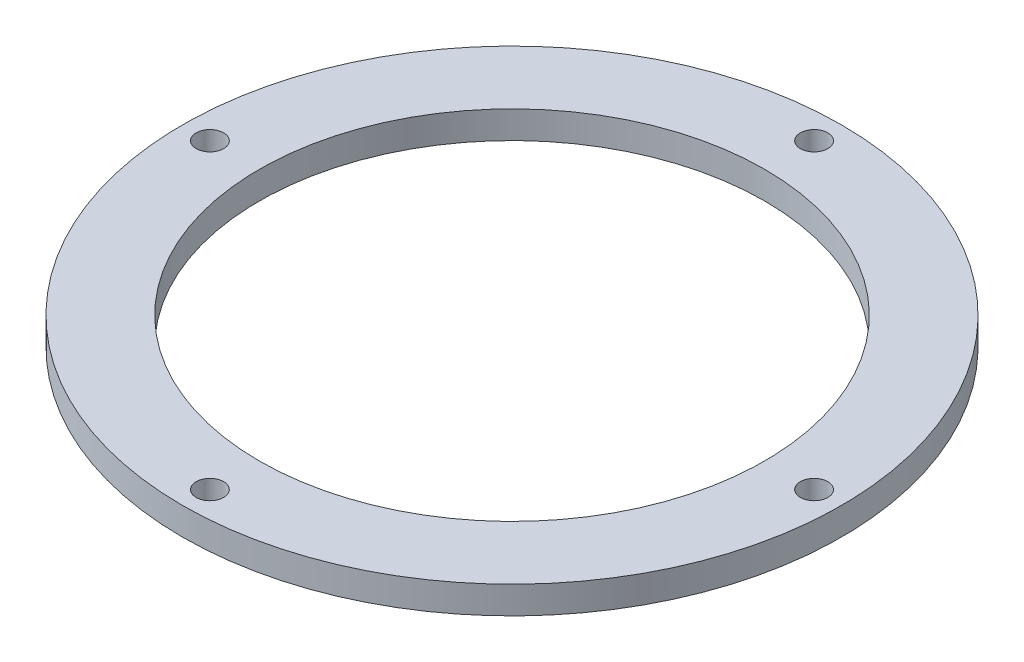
ISO-10303-21;
HEADER;
FILE_DESCRIPTION(('STEP AP214'),'2;1');
FILE_NAME('part.step','',(''),(''),'','','');
FILE_SCHEMA(('AUTOMOTIVE_DESIGN { 1 0 10303 214 1 1 1 1 }'));
ENDSEC;
DATA;
#1=APPLICATION_CONTEXT('core data for automotive mechanical design processes');
#2=APPLICATION_PROTOCOL_DEFINITION('international standard','automotive_design',2000,#1);
#3=PRODUCT_CONTEXT('',#1,'mechanical');
#4=PRODUCT('Part','Part','',(#3));
#5=PRODUCT_RELATED_PRODUCT_CATEGORY('part','',(#4));
#6=PRODUCT_DEFINITION_FORMATION('','',#4);
#7=PRODUCT_DEFINITION_CONTEXT('part definition',#1,'design');
#8=PRODUCT_DEFINITION('design','',#6,#7);
#9=PRODUCT_DEFINITION_SHAPE('','',#8);
#10=(LENGTH_UNIT() NAMED_UNIT(*) SI_UNIT(.MILLI.,.METRE.));
#11=(NAMED_UNIT(*) PLANE_ANGLE_UNIT() SI_UNIT($,.RADIAN.));
#12=(NAMED_UNIT(*) SI_UNIT($,.STERADIAN.) SOLID_ANGLE_UNIT());
#13=UNCERTAINTY_MEASURE_WITH_UNIT(LENGTH_MEASURE(1.E-05),#10,'distance_accuracy_value','');
#14=(GEOMETRIC_REPRESENTATION_CONTEXT(3) GLOBAL_UNCERTAINTY_ASSIGNED_CONTEXT((#13)) GLOBAL_UNIT_ASSIGNED_CONTEXT((#10,
#11,#12)) REPRESENTATION_CONTEXT('',''));
#15=CARTESIAN_POINT('',(0.,0.,0.));
#16=DIRECTION('',(0.,0.,1.));
#17=DIRECTION('',(1.,0.,0.));
#18=AXIS2_PLACEMENT_3D('',#15,#16,#17);
#19=CARTESIAN_POINT('',(0.,5.,0.));
#20=DIRECTION('',(0.,1.,0.));
#21=DIRECTION('',(0.,0.,1.));
#22=AXIS2_PLACEMENT_3D('',#19,#20,#21);
#23=PLANE('',#22);
#24=CARTESIAN_POINT('',(0.,5.,-55.));
#25=DIRECTION('',(0.,1.,0.));
#26=DIRECTION('',(0.,0.,1.));
#27=AXIS2_PLACEMENT_3D('',#24,#25,#26);
#28=CIRCLE('',#27,2.5);
#29=CARTESIAN_POINT('',(0.,5.,-52.5));
#30=VERTEX_POINT('',#29);
#31=EDGE_CURVE('E69',#30,#30,#28,.T.);
#32=ORIENTED_EDGE('',*,*,#31,.F.);
#33=EDGE_LOOP('',(#32));
#34=FACE_BOUND('',#33,.T.);
#35=CARTESIAN_POINT('',(55.0000000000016,5.,-1.55431223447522E-12));
#36=DIRECTION('',(0.,1.,0.));
#37=DIRECTION('',(0.,0.,1.));
#38=AXIS2_PLACEMENT_3D('',#35,#36,#37);
#39=CIRCLE('',#38,2.5);
#40=CARTESIAN_POINT('',(55.0000000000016,5.,2.49999999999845));
#41=VERTEX_POINT('',#40);
#42=EDGE_CURVE('E63',#41,#41,#39,.T.);
#43=ORIENTED_EDGE('',*,*,#42,.F.);
#44=EDGE_LOOP('',(#43));
#45=FACE_BOUND('',#44,.T.);
#46=CARTESIAN_POINT('',(3.11296127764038E-12,5.,55.));
#47=DIRECTION('',(0.,1.,0.));
#48=DIRECTION('',(0.,0.,1.));
#49=AXIS2_PLACEMENT_3D('',#46,#47,#48);
#50=CIRCLE('',#49,2.5);
#51=CARTESIAN_POINT('',(3.11296127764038E-12,5.,57.5));
#52=VERTEX_POINT('',#51);
#53=EDGE_CURVE('E57',#52,#52,#50,.T.);
#54=ORIENTED_EDGE('',*,*,#53,.F.);
#55=EDGE_LOOP('',(#54));
#56=FACE_BOUND('',#55,.T.);
#57=CARTESIAN_POINT('',(-54.9999999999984,5.,1.54737334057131E-12));
#58=DIRECTION('',(0.,1.,0.));
#59=DIRECTION('',(0.,0.,1.));
#60=AXIS2_PLACEMENT_3D('',#57,#58,#59);
#61=CIRCLE('',#60,2.5);
#62=CARTESIAN_POINT('',(-54.9999999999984,5.,2.50000000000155));
#63=VERTEX_POINT('',#62);
#64=EDGE_CURVE('E51',#63,#63,#61,.T.);
#65=ORIENTED_EDGE('',*,*,#64,.F.);
#66=EDGE_LOOP('',(#65));
#67=FACE_BOUND('',#66,.T.);
#68=CARTESIAN_POINT('',(0.,5.,0.));
#69=DIRECTION('',(0.,1.,0.));
#70=DIRECTION('',(0.,0.,1.));
#71=AXIS2_PLACEMENT_3D('',#68,#69,#70);
#72=CIRCLE('',#71,60.);
#73=CARTESIAN_POINT('',(0.,5.,60.));
#74=VERTEX_POINT('',#73);
#75=EDGE_CURVE('E10',#74,#74,#72,.T.);
#76=ORIENTED_EDGE('',*,*,#75,.T.);
#77=EDGE_LOOP('',(#76));
#78=FACE_BOUND('',#77,.T.);
#79=CARTESIAN_POINT('',(0.,5.,0.));
#80=DIRECTION('',(0.,1.,0.));
#81=DIRECTION('',(0.,0.,1.));
#82=AXIS2_PLACEMENT_3D('',#79,#80,#81);
#83=CIRCLE('',#82,46.);
#84=CARTESIAN_POINT('',(0.,5.,46.));
#85=VERTEX_POINT('',#84);
#86=EDGE_CURVE('E43',#85,#85,#83,.T.);
#87=ORIENTED_EDGE('',*,*,#86,.F.);
#88=EDGE_LOOP('',(#87));
#89=FACE_BOUND('',#88,.T.);
#90=ADVANCED_FACE('F32',(#34,#45,#56,#67,#78,#89),#23,.T.);
#91=CARTESIAN_POINT('',(0.,0.,0.));
#92=DIRECTION('',(0.,1.,0.));
#93=DIRECTION('',(0.,0.,1.));
#94=AXIS2_PLACEMENT_3D('',#91,#92,#93);
#95=PLANE('',#94);
#96=CARTESIAN_POINT('',(0.,0.,-55.));
#97=DIRECTION('',(0.,1.,0.));
#98=DIRECTION('',(0.,0.,1.));
#99=AXIS2_PLACEMENT_3D('',#96,#97,#98);
#100=CIRCLE('',#99,2.5);
#101=CARTESIAN_POINT('',(0.,0.,-52.5));
#102=VERTEX_POINT('',#101);
#103=EDGE_CURVE('E48',#102,#102,#100,.T.);
#104=ORIENTED_EDGE('',*,*,#103,.T.);
#105=EDGE_LOOP('',(#104));
#106=FACE_BOUND('',#105,.T.);
#107=CARTESIAN_POINT('',(55.0000000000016,0.,-1.55431223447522E-12));
#108=DIRECTION('',(0.,1.,0.));
#109=DIRECTION('',(0.,0.,1.));
#110=AXIS2_PLACEMENT_3D('',#107,#108,#109);
#111=CIRCLE('',#110,2.5);
#112=CARTESIAN_POINT('',(55.0000000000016,0.,2.49999999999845));
#113=VERTEX_POINT('',#112);
#114=EDGE_CURVE('E66',#113,#113,#111,.T.);
#115=ORIENTED_EDGE('',*,*,#114,.T.);
#116=EDGE_LOOP('',(#115));
#117=FACE_BOUND('',#116,.T.);
#118=CARTESIAN_POINT('',(3.11296127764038E-12,0.,55.));
#119=DIRECTION('',(0.,1.,0.));
#120=DIRECTION('',(0.,0.,1.));
#121=AXIS2_PLACEMENT_3D('',#118,#119,#120);
#122=CIRCLE('',#121,2.5);
#123=CARTESIAN_POINT('',(3.11296127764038E-12,0.,57.5));
#124=VERTEX_POINT('',#123);
#125=EDGE_CURVE('E60',#124,#124,#122,.T.);
#126=ORIENTED_EDGE('',*,*,#125,.T.);
#127=EDGE_LOOP('',(#126));
#128=FACE_BOUND('',#127,.T.);
#129=CARTESIAN_POINT('',(-54.9999999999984,0.,1.54737334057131E-12));
#130=DIRECTION('',(0.,1.,0.));
#131=DIRECTION('',(0.,0.,1.));
#132=AXIS2_PLACEMENT_3D('',#129,#130,#131);
#133=CIRCLE('',#132,2.5);
#134=CARTESIAN_POINT('',(-54.9999999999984,0.,2.50000000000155));
#135=VERTEX_POINT('',#134);
#136=EDGE_CURVE('E54',#135,#135,#133,.T.);
#137=ORIENTED_EDGE('',*,*,#136,.T.);
#138=EDGE_LOOP('',(#137));
#139=FACE_BOUND('',#138,.T.);
#140=CARTESIAN_POINT('',(0.,0.,0.));
#141=DIRECTION('',(0.,1.,0.));
#142=DIRECTION('',(0.,0.,1.));
#143=AXIS2_PLACEMENT_3D('',#140,#141,#142);
#144=CIRCLE('',#143,60.);
#145=CARTESIAN_POINT('',(0.,0.,60.));
#146=VERTEX_POINT('',#145);
#147=EDGE_CURVE('E36',#146,#146,#144,.T.);
#148=ORIENTED_EDGE('',*,*,#147,.F.);
#149=EDGE_LOOP('',(#148));
#150=FACE_BOUND('',#149,.T.);
#151=CARTESIAN_POINT('',(0.,0.,0.));
#152=DIRECTION('',(0.,1.,0.));
#153=DIRECTION('',(0.,0.,1.));
#154=AXIS2_PLACEMENT_3D('',#151,#152,#153);
#155=CIRCLE('',#154,46.);
#156=CARTESIAN_POINT('',(0.,0.,46.));
#157=VERTEX_POINT('',#156);
#158=EDGE_CURVE('E45',#157,#157,#155,.T.);
#159=ORIENTED_EDGE('',*,*,#158,.T.);
#160=EDGE_LOOP('',(#159));
#161=FACE_BOUND('',#160,.T.);
#162=ADVANCED_FACE('F75',(#106,#117,#128,#139,#150,#161),#95,.F.);
#163=CARTESIAN_POINT('',(0.,5.,0.));
#164=DIRECTION('',(0.,-1.,0.));
#165=DIRECTION('',(0.,0.,-1.));
#166=AXIS2_PLACEMENT_3D('',#163,#164,#165);
#167=CYLINDRICAL_SURFACE('',#166,60.);
#168=ORIENTED_EDGE('',*,*,#75,.F.);
#169=EDGE_LOOP('',(#168));
#170=FACE_BOUND('',#169,.T.);
#171=ORIENTED_EDGE('',*,*,#147,.T.);
#172=EDGE_LOOP('',(#171));
#173=FACE_BOUND('',#172,.T.);
#174=ADVANCED_FACE('F34',(#170,#173),#167,.T.);
#175=CARTESIAN_POINT('',(0.,5.,0.));
#176=DIRECTION('',(0.,-1.,0.));
#177=DIRECTION('',(0.,0.,-1.));
#178=AXIS2_PLACEMENT_3D('',#175,#176,#177);
#179=CYLINDRICAL_SURFACE('',#178,46.);
#180=ORIENTED_EDGE('',*,*,#86,.T.);
#181=EDGE_LOOP('',(#180));
#182=FACE_BOUND('',#181,.T.);
#183=ORIENTED_EDGE('',*,*,#158,.F.);
#184=EDGE_LOOP('',(#183));
#185=FACE_BOUND('',#184,.T.);
#186=ADVANCED_FACE('F96',(#182,#185),#179,.F.);
#187=CARTESIAN_POINT('',(-54.9999999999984,0.,1.54737334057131E-12));
#188=DIRECTION('',(0.,1.,0.));
#189=DIRECTION('',(0.,0.,1.));
#190=AXIS2_PLACEMENT_3D('',#187,#188,#189);
#191=CYLINDRICAL_SURFACE('',#190,2.5);
#192=ORIENTED_EDGE('',*,*,#136,.F.);
#193=EDGE_LOOP('',(#192));
#194=FACE_BOUND('',#193,.T.);
#195=ORIENTED_EDGE('',*,*,#64,.T.);
#196=EDGE_LOOP('',(#195));
#197=FACE_BOUND('',#196,.T.);
#198=ADVANCED_FACE('F99',(#194,#197),#191,.F.);
#199=CARTESIAN_POINT('',(3.11296127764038E-12,0.,55.));
#200=DIRECTION('',(0.,1.,0.));
#201=DIRECTION('',(0.,0.,1.));
#202=AXIS2_PLACEMENT_3D('',#199,#200,#201);
#203=CYLINDRICAL_SURFACE('',#202,2.5);
#204=ORIENTED_EDGE('',*,*,#125,.F.);
#205=EDGE_LOOP('',(#204));
#206=FACE_BOUND('',#205,.T.);
#207=ORIENTED_EDGE('',*,*,#53,.T.);
#208=EDGE_LOOP('',(#207));
#209=FACE_BOUND('',#208,.T.);
#210=ADVANCED_FACE('F111',(#206,#209),#203,.F.);
#211=CARTESIAN_POINT('',(55.0000000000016,0.,-1.55431223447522E-12));
#212=DIRECTION('',(0.,1.,0.));
#213=DIRECTION('',(0.,0.,1.));
#214=AXIS2_PLACEMENT_3D('',#211,#212,#213);
#215=CYLINDRICAL_SURFACE('',#214,2.5);
#216=ORIENTED_EDGE('',*,*,#114,.F.);
#217=EDGE_LOOP('',(#216));
#218=FACE_BOUND('',#217,.T.);
#219=ORIENTED_EDGE('',*,*,#42,.T.);
#220=EDGE_LOOP('',(#219));
#221=FACE_BOUND('',#220,.T.);
#222=ADVANCED_FACE('F81',(#218,#221),#215,.F.);
#223=CARTESIAN_POINT('',(0.,0.,-55.));
#224=DIRECTION('',(0.,1.,0.));
#225=DIRECTION('',(0.,0.,1.));
#226=AXIS2_PLACEMENT_3D('',#223,#224,#225);
#227=CYLINDRICAL_SURFACE('',#226,2.5);
#228=ORIENTED_EDGE('',*,*,#103,.F.);
#229=EDGE_LOOP('',(#228));
#230=FACE_BOUND('',#229,.T.);
#231=ORIENTED_EDGE('',*,*,#31,.T.);
#232=EDGE_LOOP('',(#231));
#233=FACE_BOUND('',#232,.T.);
#234=ADVANCED_FACE('F78',(#230,#233),#227,.F.);
#235=CLOSED_SHELL('',(#90,#162,#174,#186,#198,#210,#222,#234));
#236=MANIFOLD_SOLID_BREP('B2',#235);
#237=ADVANCED_BREP_SHAPE_REPRESENTATION('',(#18,#236),#14);
#238=SHAPE_DEFINITION_REPRESENTATION(#9,#237);
ENDSEC;
END-ISO-10303-21;
